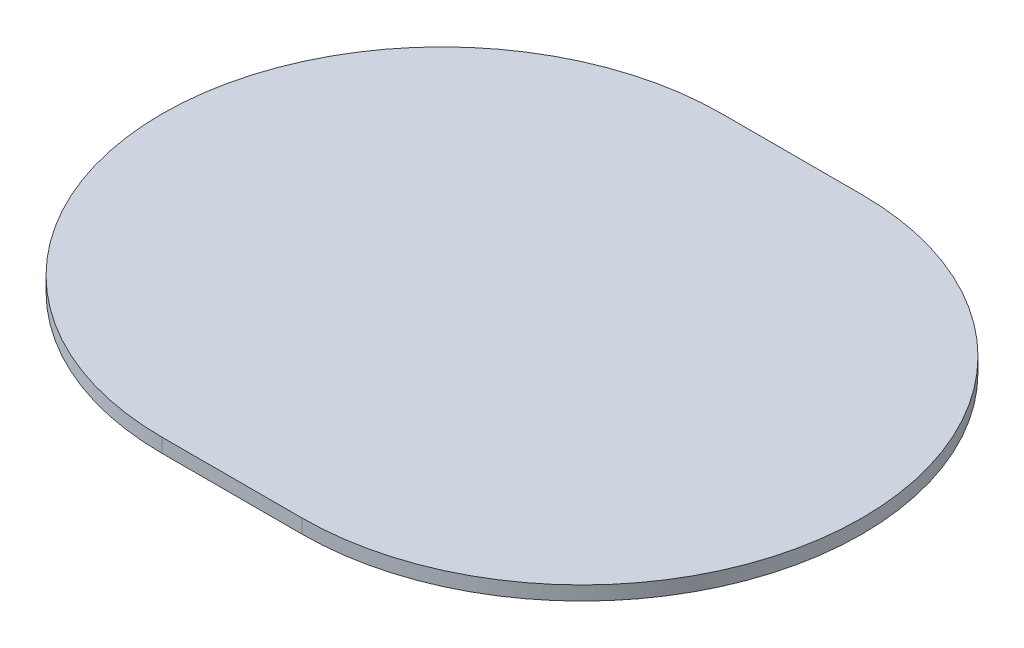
ISO-10303-21;
HEADER;
FILE_DESCRIPTION(('STEP AP214'),'2;1');
FILE_NAME('part.step','',(''),(''),'','','');
FILE_SCHEMA(('AUTOMOTIVE_DESIGN { 1 0 10303 214 1 1 1 1 }'));
ENDSEC;
DATA;
#1=APPLICATION_CONTEXT('core data for automotive mechanical design processes');
#2=APPLICATION_PROTOCOL_DEFINITION('international standard','automotive_design',2000,#1);
#3=PRODUCT_CONTEXT('',#1,'mechanical');
#4=PRODUCT('Part','Part','',(#3));
#5=PRODUCT_RELATED_PRODUCT_CATEGORY('part','',(#4));
#6=PRODUCT_DEFINITION_FORMATION('','',#4);
#7=PRODUCT_DEFINITION_CONTEXT('part definition',#1,'design');
#8=PRODUCT_DEFINITION('design','',#6,#7);
#9=PRODUCT_DEFINITION_SHAPE('','',#8);
#10=(LENGTH_UNIT() NAMED_UNIT(*) SI_UNIT(.MILLI.,.METRE.));
#11=(NAMED_UNIT(*) PLANE_ANGLE_UNIT() SI_UNIT($,.RADIAN.));
#12=(NAMED_UNIT(*) SI_UNIT($,.STERADIAN.) SOLID_ANGLE_UNIT());
#13=UNCERTAINTY_MEASURE_WITH_UNIT(LENGTH_MEASURE(1.E-05),#10,'distance_accuracy_value','');
#14=(GEOMETRIC_REPRESENTATION_CONTEXT(3) GLOBAL_UNCERTAINTY_ASSIGNED_CONTEXT((#13)) GLOBAL_UNIT_ASSIGNED_CONTEXT((#10,
#11,#12)) REPRESENTATION_CONTEXT('',''));
#15=CARTESIAN_POINT('',(0.,0.,0.));
#16=DIRECTION('',(0.,0.,1.));
#17=DIRECTION('',(1.,0.,0.));
#18=AXIS2_PLACEMENT_3D('',#15,#16,#17);
#19=CARTESIAN_POINT('',(-500.,-100.,0.));
#20=DIRECTION('',(0.,1.,0.));
#21=DIRECTION('',(0.,0.,1.));
#22=AXIS2_PLACEMENT_3D('',#19,#20,#21);
#23=CYLINDRICAL_SURFACE('',#22,2000.);
#24=CARTESIAN_POINT('',(-500.,0.,0.));
#25=DIRECTION('',(0.,1.,0.));
#26=DIRECTION('',(0.,0.,1.));
#27=AXIS2_PLACEMENT_3D('',#24,#25,#26);
#28=CIRCLE('',#27,2000.);
#29=CARTESIAN_POINT('',(-500.,0.,-2000.));
#30=VERTEX_POINT('',#29);
#31=CARTESIAN_POINT('',(-500.,0.,2000.));
#32=VERTEX_POINT('',#31);
#33=EDGE_CURVE('E98',#30,#32,#28,.T.);
#34=ORIENTED_EDGE('',*,*,#33,.F.);
#35=DIRECTION('',(0.,1.,0.));
#36=VECTOR('',#35,1.);
#37=CARTESIAN_POINT('',(-500.,-100.,-2000.));
#38=LINE('',#37,#36);
#39=CARTESIAN_POINT('',(-500.,-100.,-2000.));
#40=VERTEX_POINT('',#39);
#41=EDGE_CURVE('E11',#40,#30,#38,.T.);
#42=ORIENTED_EDGE('',*,*,#41,.F.);
#43=CARTESIAN_POINT('',(-500.,-100.,0.));
#44=DIRECTION('',(0.,1.,0.));
#45=DIRECTION('',(0.,0.,1.));
#46=AXIS2_PLACEMENT_3D('',#43,#44,#45);
#47=CIRCLE('',#46,2000.);
#48=CARTESIAN_POINT('',(-500.,-100.,2000.));
#49=VERTEX_POINT('',#48);
#50=EDGE_CURVE('E92',#40,#49,#47,.T.);
#51=ORIENTED_EDGE('',*,*,#50,.T.);
#52=DIRECTION('',(0.,1.,0.));
#53=VECTOR('',#52,1.);
#54=CARTESIAN_POINT('',(-500.,-100.,2000.));
#55=LINE('',#54,#53);
#56=EDGE_CURVE('E37',#49,#32,#55,.T.);
#57=ORIENTED_EDGE('',*,*,#56,.T.);
#58=EDGE_LOOP('',(#34,#42,#51,#57));
#59=FACE_BOUND('',#58,.T.);
#60=ADVANCED_FACE('F34',(#59),#23,.T.);
#61=CARTESIAN_POINT('',(-500.,-100.,-2000.));
#62=DIRECTION('',(0.,0.,-1.));
#63=DIRECTION('',(-1.,0.,0.));
#64=AXIS2_PLACEMENT_3D('',#61,#62,#63);
#65=PLANE('',#64);
#66=DIRECTION('',(-1.,0.,0.));
#67=VECTOR('',#66,1.);
#68=CARTESIAN_POINT('',(-500.,0.,-2000.));
#69=LINE('',#68,#67);
#70=CARTESIAN_POINT('',(499.999999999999,0.,-2000.));
#71=VERTEX_POINT('',#70);
#72=EDGE_CURVE('E94',#71,#30,#69,.T.);
#73=ORIENTED_EDGE('',*,*,#72,.F.);
#74=DIRECTION('',(0.,1.,0.));
#75=VECTOR('',#74,1.);
#76=CARTESIAN_POINT('',(499.999999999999,-100.,-2000.));
#77=LINE('',#76,#75);
#78=CARTESIAN_POINT('',(499.999999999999,-100.,-2000.));
#79=VERTEX_POINT('',#78);
#80=EDGE_CURVE('E43',#79,#71,#77,.T.);
#81=ORIENTED_EDGE('',*,*,#80,.F.);
#82=DIRECTION('',(-1.,0.,0.));
#83=VECTOR('',#82,1.);
#84=CARTESIAN_POINT('',(-500.,-100.,-2000.));
#85=LINE('',#84,#83);
#86=EDGE_CURVE('E89',#79,#40,#85,.T.);
#87=ORIENTED_EDGE('',*,*,#86,.T.);
#88=ORIENTED_EDGE('',*,*,#41,.T.);
#89=EDGE_LOOP('',(#73,#81,#87,#88));
#90=FACE_BOUND('',#89,.T.);
#91=ADVANCED_FACE('F108',(#90),#65,.T.);
#92=CARTESIAN_POINT('',(500.,-100.,-1.83697019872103E-13));
#93=DIRECTION('',(0.,1.,0.));
#94=DIRECTION('',(0.,0.,1.));
#95=AXIS2_PLACEMENT_3D('',#92,#93,#94);
#96=CYLINDRICAL_SURFACE('',#95,2000.);
#97=CARTESIAN_POINT('',(500.,0.,-1.83697019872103E-13));
#98=DIRECTION('',(0.,1.,0.));
#99=DIRECTION('',(0.,0.,1.));
#100=AXIS2_PLACEMENT_3D('',#97,#98,#99);
#101=CIRCLE('',#100,2000.);
#102=CARTESIAN_POINT('',(500.000000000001,0.,2000.));
#103=VERTEX_POINT('',#102);
#104=EDGE_CURVE('E84',#103,#71,#101,.T.);
#105=ORIENTED_EDGE('',*,*,#104,.F.);
#106=DIRECTION('',(0.,1.,0.));
#107=VECTOR('',#106,1.);
#108=CARTESIAN_POINT('',(500.000000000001,-100.,2000.));
#109=LINE('',#108,#107);
#110=CARTESIAN_POINT('',(500.000000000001,-100.,2000.));
#111=VERTEX_POINT('',#110);
#112=EDGE_CURVE('E79',#111,#103,#109,.T.);
#113=ORIENTED_EDGE('',*,*,#112,.F.);
#114=CARTESIAN_POINT('',(500.,-100.,-1.83697019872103E-13));
#115=DIRECTION('',(0.,1.,0.));
#116=DIRECTION('',(0.,0.,1.));
#117=AXIS2_PLACEMENT_3D('',#114,#115,#116);
#118=CIRCLE('',#117,2000.);
#119=EDGE_CURVE('E82',#111,#79,#118,.T.);
#120=ORIENTED_EDGE('',*,*,#119,.T.);
#121=ORIENTED_EDGE('',*,*,#80,.T.);
#122=EDGE_LOOP('',(#105,#113,#120,#121));
#123=FACE_BOUND('',#122,.T.);
#124=ADVANCED_FACE('F81',(#123),#96,.T.);
#125=CARTESIAN_POINT('',(-500.,-100.,2000.));
#126=DIRECTION('',(0.,0.,1.));
#127=DIRECTION('',(1.,0.,0.));
#128=AXIS2_PLACEMENT_3D('',#125,#126,#127);
#129=PLANE('',#128);
#130=DIRECTION('',(1.,0.,0.));
#131=VECTOR('',#130,1.);
#132=CARTESIAN_POINT('',(-500.,0.,2000.));
#133=LINE('',#132,#131);
#134=EDGE_CURVE('E101',#32,#103,#133,.T.);
#135=ORIENTED_EDGE('',*,*,#134,.F.);
#136=ORIENTED_EDGE('',*,*,#56,.F.);
#137=DIRECTION('',(1.,0.,0.));
#138=VECTOR('',#137,1.);
#139=CARTESIAN_POINT('',(-500.,-100.,2000.));
#140=LINE('',#139,#138);
#141=EDGE_CURVE('E88',#49,#111,#140,.T.);
#142=ORIENTED_EDGE('',*,*,#141,.T.);
#143=ORIENTED_EDGE('',*,*,#112,.T.);
#144=EDGE_LOOP('',(#135,#136,#142,#143));
#145=FACE_BOUND('',#144,.T.);
#146=ADVANCED_FACE('F91',(#145),#129,.T.);
#147=CARTESIAN_POINT('',(-500.,-100.,0.));
#148=DIRECTION('',(0.,1.,0.));
#149=DIRECTION('',(0.,0.,1.));
#150=AXIS2_PLACEMENT_3D('',#147,#148,#149);
#151=PLANE('',#150);
#152=ORIENTED_EDGE('',*,*,#50,.F.);
#153=ORIENTED_EDGE('',*,*,#86,.F.);
#154=ORIENTED_EDGE('',*,*,#119,.F.);
#155=ORIENTED_EDGE('',*,*,#141,.F.);
#156=EDGE_LOOP('',(#152,#153,#154,#155));
#157=FACE_BOUND('',#156,.T.);
#158=ADVANCED_FACE('F87',(#157),#151,.F.);
#159=CARTESIAN_POINT('',(-500.,0.,0.));
#160=DIRECTION('',(0.,1.,0.));
#161=DIRECTION('',(0.,0.,1.));
#162=AXIS2_PLACEMENT_3D('',#159,#160,#161);
#163=PLANE('',#162);
#164=ORIENTED_EDGE('',*,*,#33,.T.);
#165=ORIENTED_EDGE('',*,*,#134,.T.);
#166=ORIENTED_EDGE('',*,*,#104,.T.);
#167=ORIENTED_EDGE('',*,*,#72,.T.);
#168=EDGE_LOOP('',(#164,#165,#166,#167));
#169=FACE_BOUND('',#168,.T.);
#170=ADVANCED_FACE('F107',(#169),#163,.T.);
#171=CLOSED_SHELL('',(#60,#91,#124,#146,#158,#170));
#172=MANIFOLD_SOLID_BREP('B2',#171);
#173=ADVANCED_BREP_SHAPE_REPRESENTATION('',(#18,#172),#14);
#174=SHAPE_DEFINITION_REPRESENTATION(#9,#173);
ENDSEC;
END-ISO-10303-21;
